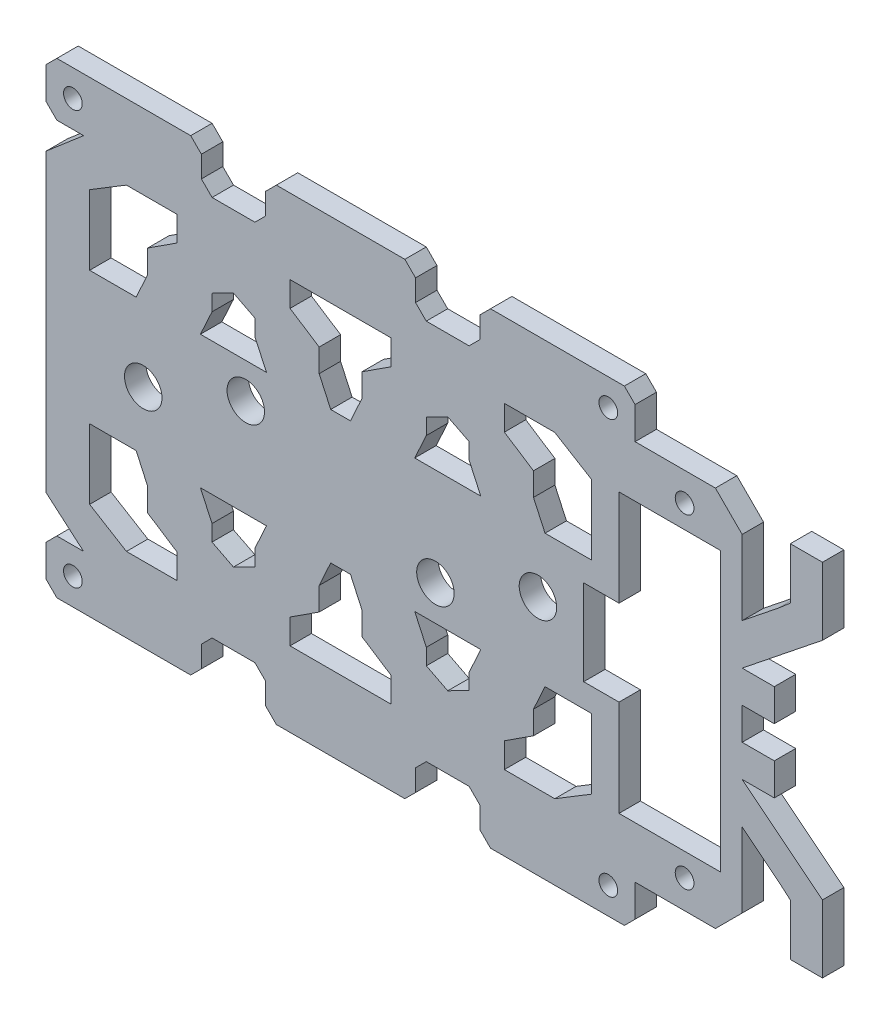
from build123d import *

# Parameters (mm, degrees)
SKETCH51_R          = 1.75
SKETCH51_R_2        = 2.5
BOSS_EXTRUDE2_DEPTH = 4
CUT_EXTRUDE5_DEPTH  = 109.658007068
CHAMFER1_SIZE       = 2
SKETCH55_R          = 3.5
CUT_EXTRUDE7_DEPTH  = 10
SKETCH57_W          = 9
SKETCH57_H          = 16
CUT_EXTRUDE8_DEPTH  = 109.658007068
CHAMFER2_SIZE       = 5
CUT_EXTRUDE9_DEPTH  = 109.658007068
SKETCH59_R          = 1.75
CUT_EXTRUDE10_DEPTH = 10


with BuildPart() as part:
    # Sketch51 → Boss-Extrude2 (new body)
    # profile 1 of 7: a face of its own
    with BuildSketch(Plane.XY):
        Polygon((-26, 60.75), (-55, 60.75), (-55, 50.75), (-48, 50.75), (-55, 44.75), (-55, -10.5), (-48, -16.5), (-55, -16.5), (-55, -26.5), (-26, -26.5), (-26, -18.5), (-14, -18.5), (-14, -26.5), (14, -26.5), (14, -18.5), (26, -18.5), (26, -26.5), (55, -26.5), (55, -18.5), (75, -18.5), (75, -12.5), (75, 0.443134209), (79.634076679, -3.261798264), (81.737039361, -4.943111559), (84, -6.880899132), (84, -10.5), (84, -16.5), (90, -16.5), (90, -3.867461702), (83.380810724, 1.424563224), (75, 8.125), (81, 8.125), (81, 14.125), (75, 14.125), (75, 20.125), (81, 20.125), (81, 26.125), (75, 26.125), (83.380810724, 32.825436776), (90, 38.117461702), (90, 50.75), (84, 50.75), (84, 44.75), (84, 41.130899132), (81.737039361, 39.193111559), (79.634076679, 37.511798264), (75, 33.806865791), (75, 46.75), (75, 52.75), (55, 52.75), (55, 54.625), (55, 60.75), (26, 60.75), (26, 52.75), (14, 52.75), (14, 60.75), (-14, 60.75), (-14, 52.75), (-26, 52.75), align=None)
        with Locations((-50, -21.5)):
            Circle(SKETCH51_R, mode=Mode.SUBTRACT)
        with Locations((-40, -22.5)):
            Circle(SKETCH51_R_2, mode=Mode.SUBTRACT)
        with Locations((0, -22.5)):
            Circle(SKETCH51_R_2, mode=Mode.SUBTRACT)
        Polygon((-41.872029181, 4.7155238), (-38.183006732, 4.7155238), (-36.027517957, 0), (-36.027517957, -2.124143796), (-36.027517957, -4.310219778), (-30.585157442, -7.835683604), (-30.585157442, -12.5), (-40, -12.5), (-46.872029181, -8.327696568), (-46.872029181, 4.7155238), align=None, mode=Mode.SUBTRACT)
        Polygon((-26.183006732, 4.7155238), (-13.844511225, 4.7155238), (-16.013758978, 0), (-16.013758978, -3), (-20.013758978, -5.036668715), (-24.013758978, -3), (-24.013758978, 0), align=None, mode=Mode.SUBTRACT)
        Polygon((-1.844511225, 4.7155238), (1.844511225, 4.7155238), (4, 0), (4, -2.124143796), (4, -4.310219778), (9.442360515, -7.835683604), (9.442360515, -12.5), (-9.442360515, -12.5), (-9.442360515, -7.835683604), (-4, -4.310219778), (-4, -2.124143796), (-4, 0), align=None, mode=Mode.SUBTRACT)
        with Locations((40, -22.5)):
            Circle(SKETCH51_R_2, mode=Mode.SUBTRACT)
        with Locations((50, -21.5)):
            Circle(SKETCH51_R, mode=Mode.SUBTRACT)
        Polygon((40, -12.5), (30.585157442, -12.5), (30.585157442, -7.835683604), (36.027517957, -4.310219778), (36.027517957, -2.124143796), (36.027517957, 0), (38.183006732, 4.7155238), (46.872029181, 4.7155238), (46.872029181, -8.327696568), align=None, mode=Mode.SUBTRACT)
        Polygon((-46.872029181, 42.577696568), (-40, 46.75), (-30.585157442, 46.75), (-30.585157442, 42.085683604), (-36.027517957, 38.560219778), (-36.027517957, 36.374143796), (-36.027517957, 34.25), (-38.183006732, 29.5344762), (-41.872029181, 29.5344762), (-46.872029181, 29.5344762), align=None, mode=Mode.SUBTRACT)
        Polygon((-13.844511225, 29.5344762), (-26.183006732, 29.5344762), (-24.013758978, 34.25), (-24.013758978, 37.25), (-20.013758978, 39.286668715), (-16.013758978, 37.25), (-16.013758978, 34.25), align=None, mode=Mode.SUBTRACT)
        Polygon((1.844511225, 29.5344762), (-1.844511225, 29.5344762), (-4, 34.25), (-4, 36.374143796), (-4, 38.560219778), (-9.442360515, 42.085683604), (-9.442360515, 46.75), (9.442360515, 46.75), (9.442360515, 42.085683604), (4, 38.560219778), (4, 36.374143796), (4, 34.25), align=None, mode=Mode.SUBTRACT)
        with Locations((-50, 55.75)):
            Circle(SKETCH51_R, mode=Mode.SUBTRACT)
        with Locations((-40, 56.75)):
            Circle(SKETCH51_R_2, mode=Mode.SUBTRACT)
        with Locations((0, 56.75)):
            Circle(SKETCH51_R_2, mode=Mode.SUBTRACT)
        Polygon((30.585157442, 46.75), (40, 46.75), (46.872029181, 42.577696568), (46.872029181, 29.5344762), (38.183006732, 29.5344762), (36.027517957, 34.25), (36.027517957, 36.374143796), (36.027517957, 38.560219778), (30.585157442, 42.085683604), align=None, mode=Mode.SUBTRACT)
        with Locations((40, 56.75)):
            Circle(SKETCH51_R_2, mode=Mode.SUBTRACT)
        with Locations((50, 55.75)):
            Circle(SKETCH51_R, mode=Mode.SUBTRACT)
    # profile 2 of 7: a face of its own
    with BuildSketch(Plane.XY):
        with Locations((40, 56.75)):
            Circle(SKETCH51_R_2)
    # profile 3 of 7: a face of its own
    with BuildSketch(Plane.XY):
        with Locations((0, 56.75)):
            Circle(SKETCH51_R_2)
    # profile 4 of 7: a face of its own
    with BuildSketch(Plane.XY):
        with Locations((40, -22.5)):
            Circle(SKETCH51_R_2)
    # profile 5 of 7: a face of its own
    with BuildSketch(Plane.XY):
        with Locations((0, -22.5)):
            Circle(SKETCH51_R_2)
    # profile 6 of 7: a face of its own
    with BuildSketch(Plane.XY):
        with Locations((-40, 56.75)):
            Circle(SKETCH51_R_2)
    # profile 7 of 7: a face of its own
    with BuildSketch(Plane.XY):
        with Locations((-40, -22.5)):
            Circle(SKETCH51_R_2)
    extrude(amount=BOSS_EXTRUDE2_DEPTH)

    # Sketch53 → Cut-Extrude5 (cut, through all)
    with BuildSketch(Plane.XY.offset(4)):
        Polygon((13.844511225, 29.5344762), (26.183006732, 29.5344762), (24.013758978, 34.25), (24.013758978, 37.25), (20.013758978, 39.286668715), (16.013758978, 37.25), (16.013758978, 34.25), align=None)
        Polygon((13.844511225, 4.7155238), (26.183006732, 4.7155238), (24.027517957, 0), (24.013758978, -3), (20.013758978, -5.036668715), (16.013758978, -3), (16.013758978, 0), align=None)
    extrude(amount=-CUT_EXTRUDE5_DEPTH, mode=Mode.SUBTRACT)

    # Chamfer1
    chamfer1_edges = [part.edges().sort_by_distance(p)[0] for p in [
        (55, -26.5, 2),
        (26, -26.5, 2),
        (26, -18.5, 2),
        (14, -18.5, 2),
        (14, -26.5, 2),
        (-14, -26.5, 2),
        (-14, -18.5, 2),
        (-26, -18.5, 2),
        (-26, -26.5, 2),
        (-55, -26.5, 2),
        (-55, -16.5, 2),
        (-55, 50.75, 2),
        (-55, 60.75, 2),
        (-26, 60.75, 2),
        (-26, 52.75, 2),
        (-14, 52.75, 2),
        (-14, 60.75, 2),
        (14, 60.75, 2),
        (14, 52.75, 2),
        (26, 52.75, 2),
        (26, 60.75, 2),
        (55, 60.75, 2),
    ]]
    chamfer(chamfer1_edges, length=CHAMFER1_SIZE)

    # Sketch55 → Cut-Extrude7 (cut)
    with BuildSketch(Plane.XY.offset(4)):
        with Locations((36.86, 18.6)):
            Circle(SKETCH55_R)
        with Locations((17.71, 11.28)):
            Circle(SKETCH55_R)
        with Locations((-17.71, 22.97)):
            Circle(SKETCH55_R)
        with Locations((-36.86, 15.65)):
            Circle(SKETCH55_R)
    extrude(amount=-CUT_EXTRUDE7_DEPTH, mode=Mode.SUBTRACT)

    # Sketch57 → Cut-Extrude8 (cut, through all)
    with BuildSketch(Plane.XY.offset(4)):
        with Locations((49.903828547, 17.125)):
            Rectangle(SKETCH57_W, SKETCH57_H)
    extrude(amount=-CUT_EXTRUDE8_DEPTH, mode=Mode.SUBTRACT)

    # Chamfer2
    chamfer2_edges = [part.edges().sort_by_distance(p)[0] for p in [
        (75, -18.5, 2),
        (75, 52.75, 2),
    ]]
    chamfer(chamfer2_edges, length=CHAMFER2_SIZE)

    # Sketch58 → Cut-Extrude9 (cut, through all)
    with BuildSketch(Plane(origin=(0, 0, 0), x_dir=(-1, 0, 0), z_dir=(0, 0, -1))):
        Polygon((-64, 43.125), (-53, 43.125), (-52, 43.125), (-52, -8.875), (-53, -8.875), (-64, -8.875), (-71, -8.875), (-71, 43.125), align=None)
    extrude(amount=-CUT_EXTRUDE9_DEPTH, mode=Mode.SUBTRACT)

    # Sketch59 → Cut-Extrude10 (cut)
    with BuildSketch(Plane(origin=(0, 0, 0), x_dir=(-1, 0, 0), z_dir=(0, 0, -1))):
        with Locations((-64.25, -13.19)):
            Circle(SKETCH59_R)
        with Locations((-64.25, 47.44)):
            Circle(SKETCH59_R)
    extrude(amount=-CUT_EXTRUDE10_DEPTH, mode=Mode.SUBTRACT)


solid = part.part
